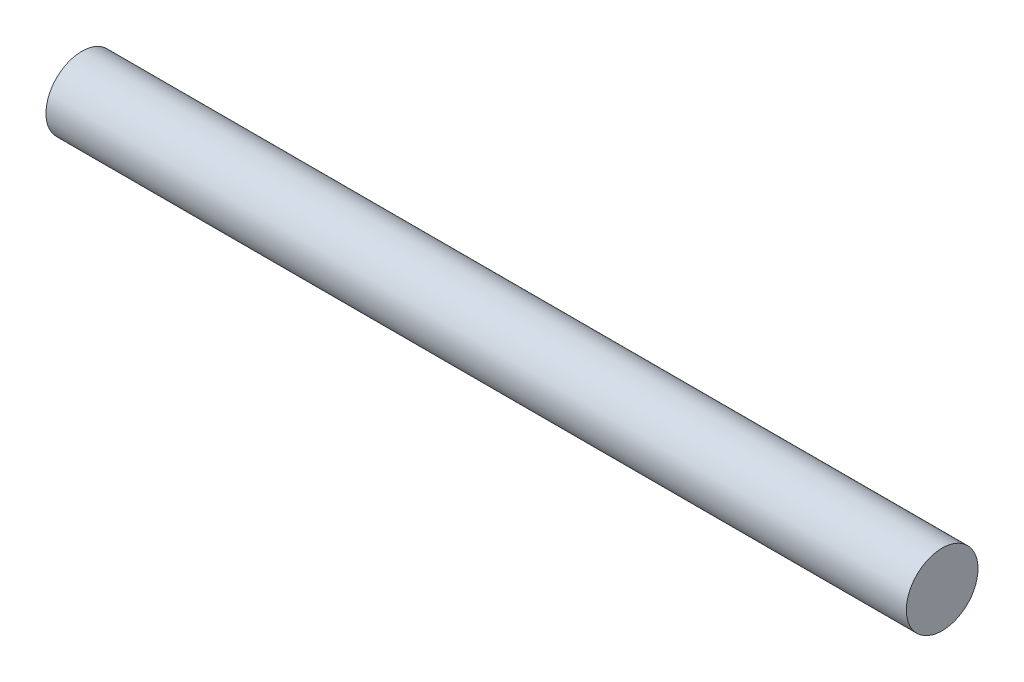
from build123d import *

# Parameters (mm, degrees)
SKETCH1_R           = 3
BOSS_EXTRUDE1_DEPTH = 72


with BuildPart() as part:
    # Sketch1 → Boss-Extrude1 (new body)
    with BuildSketch(Plane.YZ):
        with Locations(Location((0, 0, 0), (0, 0, 270))):
            Circle(SKETCH1_R)
    extrude(amount=BOSS_EXTRUDE1_DEPTH)


solid = part.part
